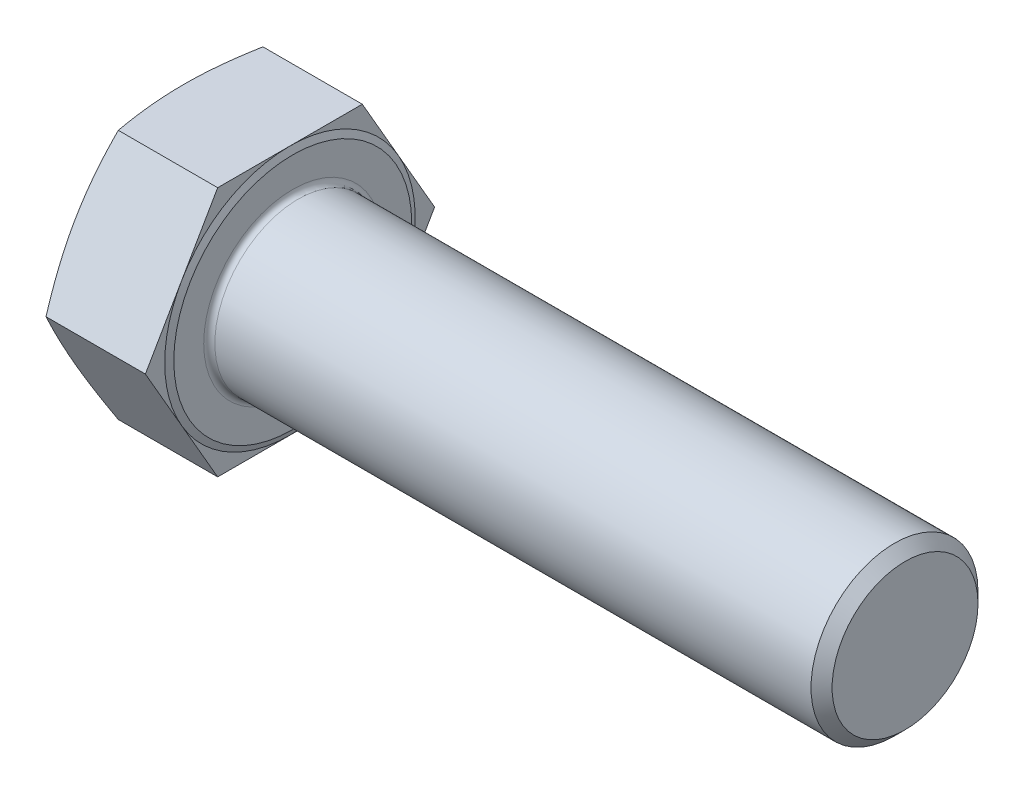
from build123d import *

# Parameters (mm, degrees)
BASEHEAD_DEPTH = 19.12
SKETCH3_R      = 15
BASEBODY_DEPTH = 110
HEADFILLET_R   = 1
CHAMFER1_SIZE  = 1.8945


with BuildPart() as part:
    # Sketch-BaseHead → BaseHead (new body)
    with BuildSketch(Plane(origin=(0, 0, 0), x_dir=(0, 0, -1), z_dir=(1, 0, 0))):
        Polygon((25.980762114, 0), (12.990381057, 22.5), (-12.990381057, 22.5), (-25.980762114, 0), (-12.990381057, -22.5), (12.990381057, -22.5), align=None)
    extrude(amount=BASEHEAD_DEPTH)

    # Sketch4 → HeadChamfer (revolve, cut)
    with BuildSketch(Plane(origin=(-0.264637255, 0, 5.916896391), x_dir=(0, 0, -1), z_dir=(0, 1, 0))):
        Polygon((31.897658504, -0.264637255), (28.416896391, -0.264637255), (31.897658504, -1.531531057), align=None)
    revolve(axis=Axis((-4.001564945, 0, 0), (1, 0, 0)), mode=Mode.SUBTRACT)

    # Sketch1 → Revolve1 (revolve)
    with BuildSketch(Plane.XY, mode=Mode.PRIVATE) as revolve1_sk:
        Polygon((19.12, 0), (19.62, 0), (19.62, -21.375), (19.12, -22.5), align=None)
    revolve(revolve1_sk.sketch.rotate(Axis((-4.001564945, 0, 0), (1, 0, 0)), 270), axis=Axis((-4.001564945, 0, 0), (1, 0, 0)))

    # Sketch3 → BaseBody (add)
    with BuildSketch(Plane(origin=(19.62, 0, 0), x_dir=(0, 0, -1), z_dir=(1, 0, 0))):
        Circle(SKETCH3_R)
    extrude(amount=BASEBODY_DEPTH)

    # HeadFillet
    headfillet_edges = [part.edges().sort_by_distance(p)[0] for p in [
        (19.62, 0, 15),
    ]]
    fillet(headfillet_edges, radius=HEADFILLET_R)

    # Chamfer1
    chamfer1_edges = [part.edges().sort_by_distance(p)[0] for p in [
        (129.62, 0, 15),
    ]]
    chamfer(chamfer1_edges, length=CHAMFER1_SIZE)


solid = part.part
